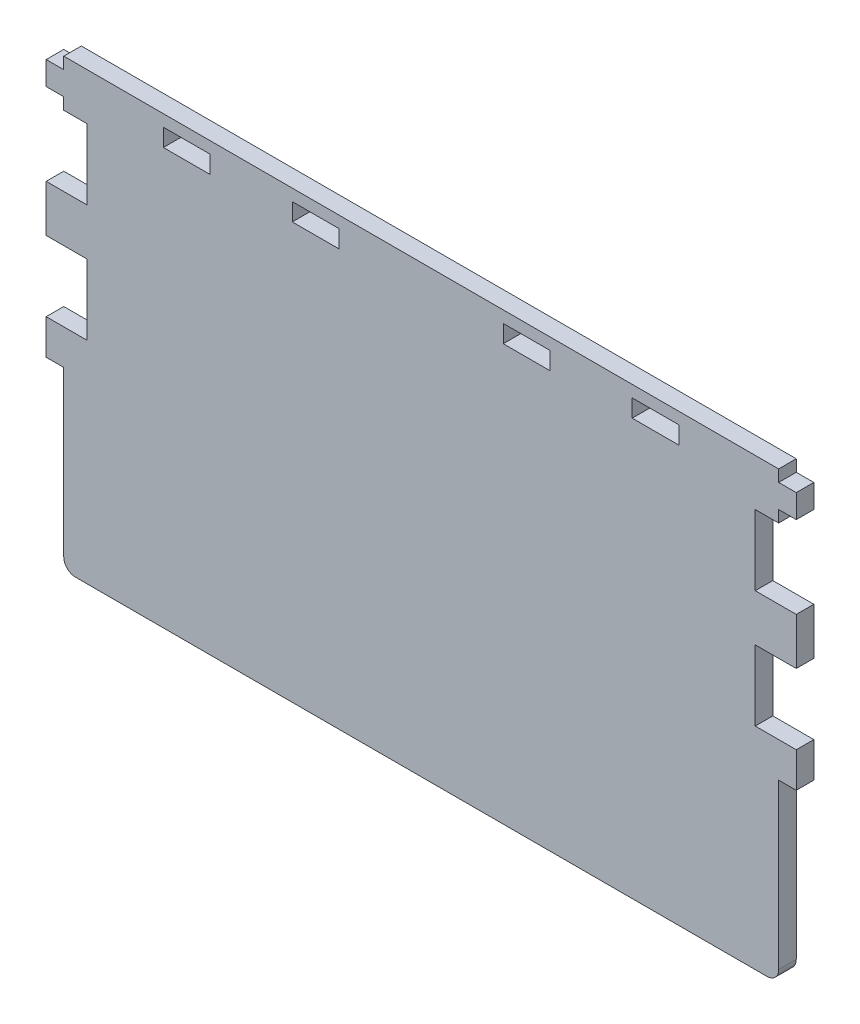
from build123d import *

# Parameters (mm, degrees)
CROQUIS1_W              = 610
CROQUIS1_H              = 380
SALIENTE_EXTRUIR1_DEPTH = 15
CROQUIS2_W              = 40
CROQUIS2_H              = 15
CORTAR_EXTRUIR1_DEPTH   = 15
REDONDEO1_R             = 10
CROQUIS3_W              = 15
CROQUIS3_H              = 40
SALIENTE_EXTRUIR2_DEPTH = 15
SALIENTE_EXTRUIR3_START = 610
CROQUIS3_2_W            = 15
CROQUIS3_2_H            = 40
SALIENTE_EXTRUIR3_DEPTH = 15
CROQUIS4_W              = 15
CROQUIS4_H              = 60
CORTAR_EXTRUIR2_DEPTH   = 20
CORTAR_EXTRUIR3_START   = 610
CROQUIS4_2_W            = 15
CROQUIS4_2_H            = 60
CORTAR_EXTRUIR3_DEPTH   = 20
CROQUIS5_W              = 15
CROQUIS5_H              = 20
SALIENTE_EXTRUIR4_DEPTH = 15
SALIENTE_EXTRUIR5_START = 610
CROQUIS5_2_W            = 15
CROQUIS5_2_H            = 20
SALIENTE_EXTRUIR5_DEPTH = 15
CROQUIS6_W              = 15
CROQUIS6_H              = 30
SALIENTE_EXTRUIR6_DEPTH = 15
SALIENTE_EXTRUIR7_START = 610
CROQUIS6_2_W            = 15
CROQUIS6_2_H            = 30
SALIENTE_EXTRUIR7_DEPTH = 15


with BuildPart() as part:
    # Croquis1 → Saliente-Extruir1 (new body)
    with BuildSketch(Plane.XY):
        with Locations((305, 190)):
            Rectangle(CROQUIS1_W, CROQUIS1_H)
    extrude(amount=SALIENTE_EXTRUIR1_DEPTH)

    # Croquis2 → Cortar-Extruir1 (cut)
    with BuildSketch(Plane.XY):
        with Locations((215, 362.5)):
            Rectangle(CROQUIS2_W, CROQUIS2_H)
        with Locations((105, 362.5)):
            Rectangle(CROQUIS2_W, CROQUIS2_H)
        with Locations((395, 362.5)):
            Rectangle(CROQUIS2_W, CROQUIS2_H)
        with Locations((505, 362.5)):
            Rectangle(CROQUIS2_W, CROQUIS2_H)
    extrude(amount=CORTAR_EXTRUIR1_DEPTH, mode=Mode.SUBTRACT)

    # Redondeo1
    redondeo1_edges = [part.edges().sort_by_distance(p)[0] for p in [
        (610, 0, 7.5),
        (0, 0, 7.5),
    ]]
    fillet(redondeo1_edges, radius=REDONDEO1_R)

    # Croquis3 → Saliente-Extruir2 (add)
    with BuildSketch(Plane(origin=(0, 0, 0), x_dir=(0, 0, -1), z_dir=(1, 0, 0))):
        with Locations((-7.5, 260)):
            Rectangle(CROQUIS3_W, CROQUIS3_H)
    extrude(amount=-SALIENTE_EXTRUIR2_DEPTH)

    # Croquis3_2 → Saliente-Extruir3 (add)
    with BuildSketch(Plane(origin=(0, 0, 0), x_dir=(0, 0, -1), z_dir=(1, 0, 0)).offset(SALIENTE_EXTRUIR3_START)):
        with Locations((-7.5, 260)):
            Rectangle(CROQUIS3_2_W, CROQUIS3_2_H)
    extrude(amount=SALIENTE_EXTRUIR3_DEPTH)

    # Croquis4 → Cortar-Extruir2 (cut)
    with BuildSketch(Plane(origin=(0, 0, 0), x_dir=(0, 0, -1), z_dir=(1, 0, 0))):
        with Locations((-7.5, 310)):
            Rectangle(CROQUIS4_W, CROQUIS4_H)
        with Locations((-7.5, 210)):
            Rectangle(CROQUIS4_W, CROQUIS4_H)
    extrude(amount=CORTAR_EXTRUIR2_DEPTH, mode=Mode.SUBTRACT)

    # Croquis4_2 → Cortar-Extruir3 (cut)
    with BuildSketch(Plane(origin=(0, 0, 0), x_dir=(0, 0, -1), z_dir=(1, 0, 0)).offset(CORTAR_EXTRUIR3_START)):
        with Locations((-7.5, 310)):
            Rectangle(CROQUIS4_2_W, CROQUIS4_2_H)
        with Locations((-7.5, 210)):
            Rectangle(CROQUIS4_2_W, CROQUIS4_2_H)
    extrude(amount=-CORTAR_EXTRUIR3_DEPTH, mode=Mode.SUBTRACT)

    # Croquis5 → Saliente-Extruir4 (add)
    with BuildSketch(Plane(origin=(0, 0, 0), x_dir=(0, 0, -1), z_dir=(1, 0, 0))):
        with Locations((-7.5, 360)):
            Rectangle(CROQUIS5_W, CROQUIS5_H)
    extrude(amount=-SALIENTE_EXTRUIR4_DEPTH)

    # Croquis5_2 → Saliente-Extruir5 (add)
    with BuildSketch(Plane(origin=(0, 0, 0), x_dir=(0, 0, -1), z_dir=(1, 0, 0)).offset(SALIENTE_EXTRUIR5_START)):
        with Locations((-7.5, 360)):
            Rectangle(CROQUIS5_2_W, CROQUIS5_2_H)
    extrude(amount=SALIENTE_EXTRUIR5_DEPTH)

    # Croquis6 → Saliente-Extruir6 (add)
    with BuildSketch(Plane(origin=(0, 0, 0), x_dir=(0, 0, -1), z_dir=(1, 0, 0))):
        with Locations((-7.5, 165)):
            Rectangle(CROQUIS6_W, CROQUIS6_H)
    extrude(amount=-SALIENTE_EXTRUIR6_DEPTH)

    # Croquis6_2 → Saliente-Extruir7 (add)
    with BuildSketch(Plane(origin=(0, 0, 0), x_dir=(0, 0, -1), z_dir=(1, 0, 0)).offset(SALIENTE_EXTRUIR7_START)):
        with Locations((-7.5, 165)):
            Rectangle(CROQUIS6_2_W, CROQUIS6_2_H)
    extrude(amount=SALIENTE_EXTRUIR7_DEPTH)


solid = part.part
